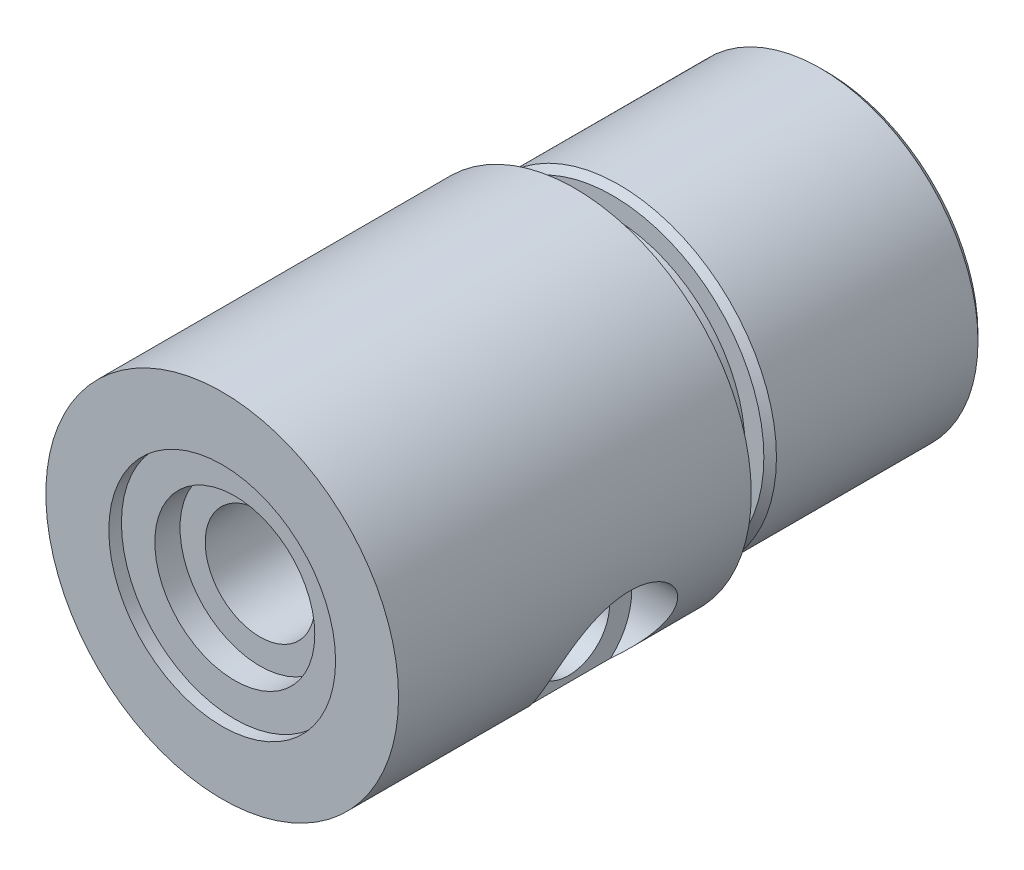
from build123d import *

# Parameters (mm, degrees)
SKETCH1_R                      = 12.5
BOSS_EXTRUDE1_DEPTH            = 17
SKETCH2_R                      = 10.5
BOSS_EXTRUDE2_DEPTH            = 3
SKETCH3_R                      = 14
BOSS_EXTRUDE3_DEPTH            = 28
SKETCH4_R                      = 8
CUT_EXTRUDE1_DEPTH             = 20
SKETCH9_R                      = 3.25
CUT_EXTRUDE4_DEPTH             = 28
SKETCH11_R                     = 0.5
CUT_EXTRUDE6_DEPTH             = 8
M3_CLEARANCE_HOLE1_D           = 3.4
M3_CLEARANCE_HOLE1_DEPTH       = 5
M3_CLEARANCE_HOLE1_TIP         = 1.021463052
CHAMFER1_SIZE                  = 0.5
CHAMFER2_SIZE                  = 0.5
SKETCH19_R                     = 5
CUT_EXTRUDE7_DEPTH             = 5
CUT_EXTRUDE10_START            = 5
SKETCH20_R                     = 5
CUT_EXTRUDE10_DEPTH            = 5
SKETCH21_R                     = 9
CUT_EXTRUDE11_DEPTH            = 1
SKETCH23_R                     = 0.5
CUT_EXTRUDE13_DEPTH            = 15
SKETCH24_R                     = 6.35
CUT_EXTRUDE14_DEPTH            = 2
F_8_7_8_7_DIAMETER_HOLE1_D     = 8.7
F_8_7_8_7_DIAMETER_HOLE1_DEPTH = 10
F_8_7_8_7_DIAMETER_HOLE1_TIP   = 2.613743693


with BuildPart() as part:
    # Sketch1 → Boss-Extrude1 (new body)
    with BuildSketch(Plane.XY):
        Circle(SKETCH1_R)
    extrude(amount=BOSS_EXTRUDE1_DEPTH)

    # Sketch2 → Boss-Extrude2 (add)
    with BuildSketch(Plane.XY.offset(17)):
        Circle(SKETCH2_R)
    extrude(amount=BOSS_EXTRUDE2_DEPTH)

    # Sketch3 → Boss-Extrude3 (add)
    with BuildSketch(Plane.XY.offset(20)):
        Circle(SKETCH3_R)
    extrude(amount=BOSS_EXTRUDE3_DEPTH)

    # Sketch4 → Cut-Extrude1 (cut)
    with BuildSketch(Plane(origin=(0, 0, 0), x_dir=(-1, 0, 0), z_dir=(0, 0, -1))):
        Circle(SKETCH4_R)
    extrude(amount=-CUT_EXTRUDE1_DEPTH, mode=Mode.SUBTRACT)

    # Sketch9 → Cut-Extrude4 (cut)
    with BuildSketch(Plane(origin=(14, 0, 0), x_dir=(0, 0, -1), z_dir=(1, 0, 0))):
        with Locations((-29.5, -7)):
            Circle(SKETCH9_R)
    extrude(amount=-CUT_EXTRUDE4_DEPTH, mode=Mode.SUBTRACT)

    # Sketch11 → Cut-Extrude6 (cut)
    with BuildSketch(Plane(origin=(0, 0, 20), x_dir=(-1, 0, 0), z_dir=(0, 0, -1))):
        with Locations((0, -5.23092093)):
            Circle(SKETCH11_R)
    extrude(amount=-CUT_EXTRUDE6_DEPTH, mode=Mode.SUBTRACT)

    # M3 Clearance Hole1
    with Locations(Plane(origin=(0, 0, 20), x_dir=(-1, 0, 0), z_dir=(0, 0, -1))):
        with Locations((0, -5.23092093)):
            Hole(M3_CLEARANCE_HOLE1_D / 2, depth=M3_CLEARANCE_HOLE1_DEPTH)
            with Locations((0, 0, -(M3_CLEARANCE_HOLE1_DEPTH + M3_CLEARANCE_HOLE1_TIP / 2))):  # 118° drill point
                Cone(0, M3_CLEARANCE_HOLE1_D / 2, M3_CLEARANCE_HOLE1_TIP, mode=Mode.SUBTRACT)

    # Chamfer1
    chamfer1_edges = [part.edges().sort_by_distance(p)[0] for p in [
        (-12.5, 0, 0),
    ]]
    chamfer(chamfer1_edges, length=CHAMFER1_SIZE)

    # Chamfer2
    chamfer2_edges = [part.edges().sort_by_distance(p)[0] for p in [
        (-12.5, 0, 17),
    ]]
    chamfer(chamfer2_edges, length=CHAMFER2_SIZE)

    # Sketch19 → Cut-Extrude7 (cut)
    with BuildSketch(Plane(origin=(14, 0, 0), x_dir=(0, 0, -1), z_dir=(1, 0, 0))):
        with Locations((-29.5, -7)):
            Circle(SKETCH19_R)
    extrude(amount=-CUT_EXTRUDE7_DEPTH, mode=Mode.SUBTRACT)

    # Sketch20 → Cut-Extrude10 (cut)
    with BuildSketch(Plane(origin=(-14, 0, 0), x_dir=(0, 0, -1), z_dir=(1, 0, 0)).offset(CUT_EXTRUDE10_START)):
        with Locations((-29.5, -7)):
            Circle(SKETCH20_R)
    extrude(amount=-CUT_EXTRUDE10_DEPTH, mode=Mode.SUBTRACT)

    # Sketch21 → Cut-Extrude11 (cut)
    with BuildSketch(Plane.XY.offset(48)):
        Circle(SKETCH21_R)
    extrude(amount=-CUT_EXTRUDE11_DEPTH, mode=Mode.SUBTRACT)

    # Sketch23 → Cut-Extrude13 (cut)
    with BuildSketch(Plane(origin=(0, 0, 20), x_dir=(-1, 0, 0), z_dir=(0, 0, -1))):
        with Locations((0, 2.5)):
            Circle(SKETCH23_R)
    extrude(amount=-CUT_EXTRUDE13_DEPTH, mode=Mode.SUBTRACT)

    # Sketch24 → Cut-Extrude14 (cut)
    with BuildSketch(Plane.XY.offset(47)):
        Circle(SKETCH24_R)
    extrude(amount=-CUT_EXTRUDE14_DEPTH, mode=Mode.SUBTRACT)

    # 8.7 _8.7_ Diameter Hole1
    with Locations(Plane.XY.offset(45)):
        with Locations((0, 0)):
            Hole(F_8_7_8_7_DIAMETER_HOLE1_D / 2, depth=F_8_7_8_7_DIAMETER_HOLE1_DEPTH)
            with Locations((0, 0, -(F_8_7_8_7_DIAMETER_HOLE1_DEPTH + F_8_7_8_7_DIAMETER_HOLE1_TIP / 2))):  # 118° drill point
                Cone(0, F_8_7_8_7_DIAMETER_HOLE1_D / 2, F_8_7_8_7_DIAMETER_HOLE1_TIP, mode=Mode.SUBTRACT)


solid = part.part
